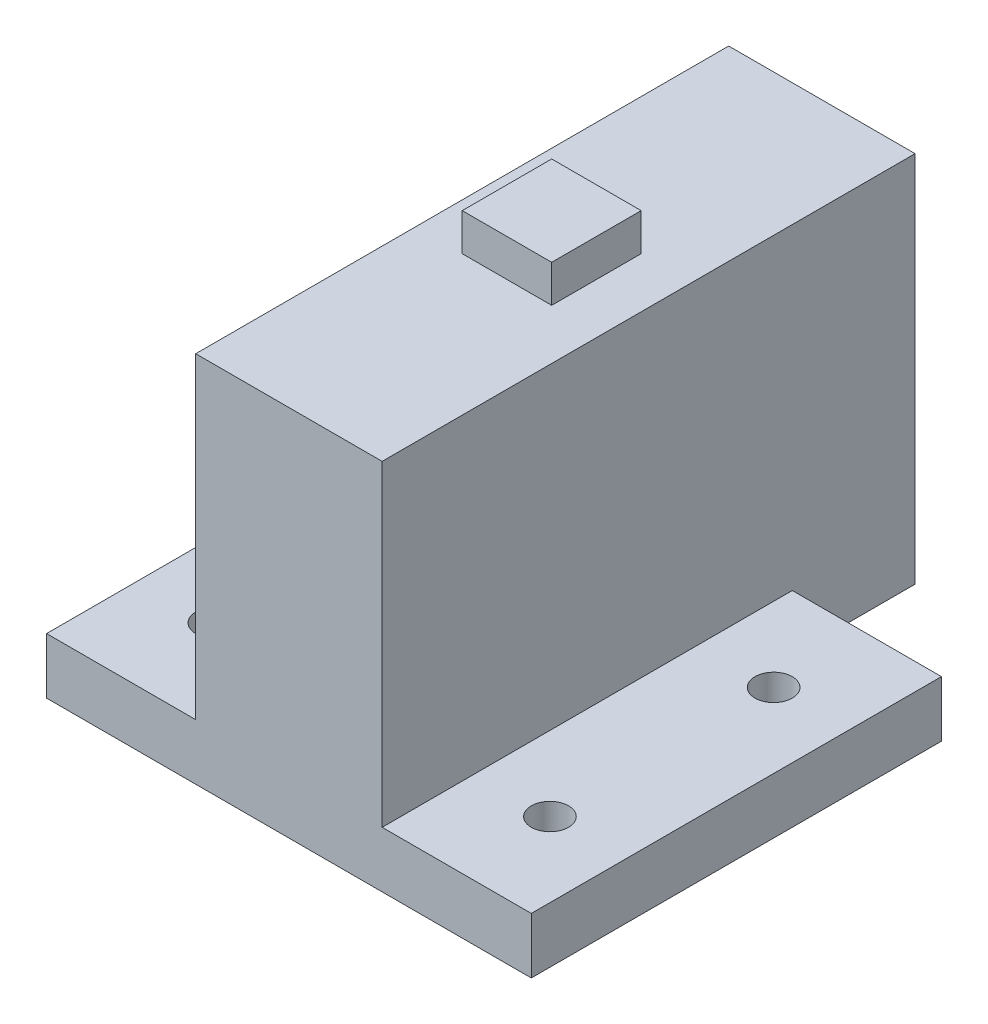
ISO-10303-21;
HEADER;
FILE_DESCRIPTION(('STEP AP214'),'2;1');
FILE_NAME('part.step','',(''),(''),'','','');
FILE_SCHEMA(('AUTOMOTIVE_DESIGN { 1 0 10303 214 1 1 1 1 }'));
ENDSEC;
DATA;
#1=APPLICATION_CONTEXT('core data for automotive mechanical design processes');
#2=APPLICATION_PROTOCOL_DEFINITION('international standard','automotive_design',2000,#1);
#3=PRODUCT_CONTEXT('',#1,'mechanical');
#4=PRODUCT('Part','Part','',(#3));
#5=PRODUCT_RELATED_PRODUCT_CATEGORY('part','',(#4));
#6=PRODUCT_DEFINITION_FORMATION('','',#4);
#7=PRODUCT_DEFINITION_CONTEXT('part definition',#1,'design');
#8=PRODUCT_DEFINITION('design','',#6,#7);
#9=PRODUCT_DEFINITION_SHAPE('','',#8);
#10=(LENGTH_UNIT() NAMED_UNIT(*) SI_UNIT(.MILLI.,.METRE.));
#11=(NAMED_UNIT(*) PLANE_ANGLE_UNIT() SI_UNIT($,.RADIAN.));
#12=(NAMED_UNIT(*) SI_UNIT($,.STERADIAN.) SOLID_ANGLE_UNIT());
#13=UNCERTAINTY_MEASURE_WITH_UNIT(LENGTH_MEASURE(1.E-05),#10,'distance_accuracy_value','');
#14=(GEOMETRIC_REPRESENTATION_CONTEXT(3) GLOBAL_UNCERTAINTY_ASSIGNED_CONTEXT((#13)) GLOBAL_UNIT_ASSIGNED_CONTEXT((#10,
#11,#12)) REPRESENTATION_CONTEXT('',''));
#15=CARTESIAN_POINT('',(0.,0.,0.));
#16=DIRECTION('',(0.,0.,1.));
#17=DIRECTION('',(1.,0.,0.));
#18=AXIS2_PLACEMENT_3D('',#15,#16,#17);
#19=CARTESIAN_POINT('',(-20.,250.,0.));
#20=DIRECTION('',(1.,0.,0.));
#21=DIRECTION('',(0.,0.,-1.));
#22=AXIS2_PLACEMENT_3D('',#19,#20,#21);
#23=PLANE('',#22);
#24=DIRECTION('',(0.,0.,1.));
#25=VECTOR('',#24,1.);
#26=CARTESIAN_POINT('',(-20.,100.,0.));
#27=LINE('',#26,#25);
#28=CARTESIAN_POINT('',(-20.,100.,-142.943134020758));
#29=VERTEX_POINT('',#28);
#30=CARTESIAN_POINT('',(-20.,100.,0.));
#31=VERTEX_POINT('',#30);
#32=EDGE_CURVE('E276',#29,#31,#27,.T.);
#33=ORIENTED_EDGE('',*,*,#32,.F.);
#34=DIRECTION('',(0.,-1.,0.));
#35=VECTOR('',#34,1.);
#36=CARTESIAN_POINT('',(-20.,250.,-142.943134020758));
#37=LINE('',#36,#35);
#38=CARTESIAN_POINT('',(-19.9999999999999,0.,-142.943134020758));
#39=VERTEX_POINT('',#38);
#40=EDGE_CURVE('E392',#29,#39,#37,.T.);
#41=ORIENTED_EDGE('',*,*,#40,.T.);
#42=DIRECTION('',(0.,0.,-1.));
#43=VECTOR('',#42,1.);
#44=CARTESIAN_POINT('',(-20.,0.,0.));
#45=LINE('',#44,#43);
#46=CARTESIAN_POINT('',(-20.,0.,-110.));
#47=VERTEX_POINT('',#46);
#48=EDGE_CURVE('E383',#47,#39,#45,.T.);
#49=ORIENTED_EDGE('',*,*,#48,.F.);
#50=DIRECTION('',(0.,-1.,0.));
#51=VECTOR('',#50,1.);
#52=CARTESIAN_POINT('',(-20.,0.,-110.));
#53=LINE('',#52,#51);
#54=CARTESIAN_POINT('',(-20.,15.,-110.));
#55=VERTEX_POINT('',#54);
#56=EDGE_CURVE('E321',#55,#47,#53,.T.);
#57=ORIENTED_EDGE('',*,*,#56,.F.);
#58=DIRECTION('',(0.,0.,-1.));
#59=VECTOR('',#58,1.);
#60=CARTESIAN_POINT('',(-20.,15.,-110.));
#61=LINE('',#60,#59);
#62=CARTESIAN_POINT('',(-20.,15.,0.));
#63=VERTEX_POINT('',#62);
#64=EDGE_CURVE('E312',#63,#55,#61,.T.);
#65=ORIENTED_EDGE('',*,*,#64,.F.);
#66=DIRECTION('',(0.,-1.,0.));
#67=VECTOR('',#66,1.);
#68=CARTESIAN_POINT('',(-20.,250.,0.));
#69=LINE('',#68,#67);
#70=EDGE_CURVE('E398',#31,#63,#69,.T.);
#71=ORIENTED_EDGE('',*,*,#70,.F.);
#72=EDGE_LOOP('',(#33,#41,#49,#57,#65,#71));
#73=FACE_BOUND('',#72,.T.);
#74=ADVANCED_FACE('F52',(#73),#23,.F.);
#75=CARTESIAN_POINT('',(30.,250.,-150.));
#76=DIRECTION('',(-1.,0.,0.));
#77=DIRECTION('',(0.,0.,1.));
#78=AXIS2_PLACEMENT_3D('',#75,#76,#77);
#79=PLANE('',#78);
#80=DIRECTION('',(0.,0.,-1.));
#81=VECTOR('',#80,1.);
#82=CARTESIAN_POINT('',(30.,100.,-150.));
#83=LINE('',#82,#81);
#84=CARTESIAN_POINT('',(30.,100.,0.));
#85=VERTEX_POINT('',#84);
#86=CARTESIAN_POINT('',(30.,100.,-142.943134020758));
#87=VERTEX_POINT('',#86);
#88=EDGE_CURVE('E273',#85,#87,#83,.T.);
#89=ORIENTED_EDGE('',*,*,#88,.F.);
#90=DIRECTION('',(0.,-1.,0.));
#91=VECTOR('',#90,1.);
#92=CARTESIAN_POINT('',(30.,250.,0.));
#93=LINE('',#92,#91);
#94=CARTESIAN_POINT('',(30.,15.,0.));
#95=VERTEX_POINT('',#94);
#96=EDGE_CURVE('E61',#85,#95,#93,.T.);
#97=ORIENTED_EDGE('',*,*,#96,.T.);
#98=DIRECTION('',(0.,0.,1.));
#99=VECTOR('',#98,1.);
#100=CARTESIAN_POINT('',(30.,15.,0.));
#101=LINE('',#100,#99);
#102=CARTESIAN_POINT('',(30.,15.,-110.));
#103=VERTEX_POINT('',#102);
#104=EDGE_CURVE('E354',#103,#95,#101,.T.);
#105=ORIENTED_EDGE('',*,*,#104,.F.);
#106=DIRECTION('',(0.,1.,0.));
#107=VECTOR('',#106,1.);
#108=CARTESIAN_POINT('',(30.,15.,-110.));
#109=LINE('',#108,#107);
#110=CARTESIAN_POINT('',(30.,0.,-110.));
#111=VERTEX_POINT('',#110);
#112=EDGE_CURVE('E348',#111,#103,#109,.T.);
#113=ORIENTED_EDGE('',*,*,#112,.F.);
#114=DIRECTION('',(0.,0.,1.));
#115=VECTOR('',#114,1.);
#116=CARTESIAN_POINT('',(30.,0.,-235.));
#117=LINE('',#116,#115);
#118=CARTESIAN_POINT('',(30.,0.,-142.943134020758));
#119=VERTEX_POINT('',#118);
#120=EDGE_CURVE('E382',#119,#111,#117,.T.);
#121=ORIENTED_EDGE('',*,*,#120,.F.);
#122=DIRECTION('',(0.,-1.,0.));
#123=VECTOR('',#122,1.);
#124=CARTESIAN_POINT('',(30.,250.,-142.943134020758));
#125=LINE('',#124,#123);
#126=EDGE_CURVE('E387',#87,#119,#125,.T.);
#127=ORIENTED_EDGE('',*,*,#126,.F.);
#128=EDGE_LOOP('',(#89,#97,#105,#113,#121,#127));
#129=FACE_BOUND('',#128,.T.);
#130=ADVANCED_FACE('F404',(#129),#79,.F.);
#131=CARTESIAN_POINT('',(-20.,250.,0.));
#132=DIRECTION('',(0.,0.,-1.));
#133=DIRECTION('',(-1.,0.,0.));
#134=AXIS2_PLACEMENT_3D('',#131,#132,#133);
#135=PLANE('',#134);
#136=DIRECTION('',(-1.,0.,0.));
#137=VECTOR('',#136,1.);
#138=CARTESIAN_POINT('',(71.,100.,0.));
#139=LINE('',#138,#137);
#140=EDGE_CURVE('E269',#85,#31,#139,.T.);
#141=ORIENTED_EDGE('',*,*,#140,.T.);
#142=ORIENTED_EDGE('',*,*,#70,.T.);
#143=DIRECTION('',(1.,0.,0.));
#144=VECTOR('',#143,1.);
#145=CARTESIAN_POINT('',(-60.,15.,0.));
#146=LINE('',#145,#144);
#147=CARTESIAN_POINT('',(-60.,15.,0.));
#148=VERTEX_POINT('',#147);
#149=EDGE_CURVE('E344',#148,#63,#146,.T.);
#150=ORIENTED_EDGE('',*,*,#149,.F.);
#151=DIRECTION('',(0.,1.,0.));
#152=VECTOR('',#151,1.);
#153=CARTESIAN_POINT('',(-60.,15.,0.));
#154=LINE('',#153,#152);
#155=CARTESIAN_POINT('',(-60.,0.,0.));
#156=VERTEX_POINT('',#155);
#157=EDGE_CURVE('E320',#156,#148,#154,.T.);
#158=ORIENTED_EDGE('',*,*,#157,.F.);
#159=DIRECTION('',(1.,0.,0.));
#160=VECTOR('',#159,1.);
#161=CARTESIAN_POINT('',(-20.,0.,0.));
#162=LINE('',#161,#160);
#163=CARTESIAN_POINT('',(70.,0.,0.));
#164=VERTEX_POINT('',#163);
#165=EDGE_CURVE('E395',#156,#164,#162,.T.);
#166=ORIENTED_EDGE('',*,*,#165,.T.);
#167=DIRECTION('',(0.,-1.,0.));
#168=VECTOR('',#167,1.);
#169=CARTESIAN_POINT('',(70.,0.,0.));
#170=LINE('',#169,#168);
#171=CARTESIAN_POINT('',(70.,15.,0.));
#172=VERTEX_POINT('',#171);
#173=EDGE_CURVE('E360',#172,#164,#170,.T.);
#174=ORIENTED_EDGE('',*,*,#173,.F.);
#175=DIRECTION('',(-1.,0.,0.));
#176=VECTOR('',#175,1.);
#177=CARTESIAN_POINT('',(70.,15.,0.));
#178=LINE('',#177,#176);
#179=EDGE_CURVE('E364',#172,#95,#178,.T.);
#180=ORIENTED_EDGE('',*,*,#179,.T.);
#181=ORIENTED_EDGE('',*,*,#96,.F.);
#182=EDGE_LOOP('',(#141,#142,#150,#158,#166,#174,#180,#181));
#183=FACE_BOUND('',#182,.T.);
#184=ADVANCED_FACE('F54',(#183),#135,.F.);
#185=CARTESIAN_POINT('',(-91.,250.,-142.943134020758));
#186=DIRECTION('',(0.,0.,1.));
#187=DIRECTION('',(0.,-1.,0.));
#188=AXIS2_PLACEMENT_3D('',#185,#186,#187);
#189=PLANE('',#188);
#190=DIRECTION('',(1.,0.,0.));
#191=VECTOR('',#190,1.);
#192=CARTESIAN_POINT('',(17.5,62.5,-142.943134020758));
#193=LINE('',#192,#191);
#194=CARTESIAN_POINT('',(-7.49999999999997,62.5,-142.943134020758));
#195=VERTEX_POINT('',#194);
#196=CARTESIAN_POINT('',(17.5,62.5,-142.943134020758));
#197=VERTEX_POINT('',#196);
#198=EDGE_CURVE('E213',#195,#197,#193,.T.);
#199=ORIENTED_EDGE('',*,*,#198,.F.);
#200=DIRECTION('',(0.,1.,0.));
#201=VECTOR('',#200,1.);
#202=CARTESIAN_POINT('',(-7.49999999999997,37.5,-142.943134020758));
#203=LINE('',#202,#201);
#204=CARTESIAN_POINT('',(-7.49999999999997,37.5,-142.943134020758));
#205=VERTEX_POINT('',#204);
#206=EDGE_CURVE('E68',#205,#195,#203,.T.);
#207=ORIENTED_EDGE('',*,*,#206,.F.);
#208=DIRECTION('',(-1.,0.,0.));
#209=VECTOR('',#208,1.);
#210=CARTESIAN_POINT('',(17.5,37.5,-142.943134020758));
#211=LINE('',#210,#209);
#212=CARTESIAN_POINT('',(17.5,37.5,-142.943134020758));
#213=VERTEX_POINT('',#212);
#214=EDGE_CURVE('E200',#213,#205,#211,.T.);
#215=ORIENTED_EDGE('',*,*,#214,.F.);
#216=DIRECTION('',(0.,-1.,0.));
#217=VECTOR('',#216,1.);
#218=CARTESIAN_POINT('',(17.5,37.5,-142.943134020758));
#219=LINE('',#218,#217);
#220=EDGE_CURVE('E204',#197,#213,#219,.T.);
#221=ORIENTED_EDGE('',*,*,#220,.F.);
#222=EDGE_LOOP('',(#199,#207,#215,#221));
#223=FACE_BOUND('',#222,.T.);
#224=DIRECTION('',(-1.,0.,0.));
#225=VECTOR('',#224,1.);
#226=CARTESIAN_POINT('',(-91.,100.,-142.943134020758));
#227=LINE('',#226,#225);
#228=EDGE_CURVE('E12',#87,#29,#227,.T.);
#229=ORIENTED_EDGE('',*,*,#228,.F.);
#230=ORIENTED_EDGE('',*,*,#126,.T.);
#231=DIRECTION('',(-1.,0.,0.));
#232=VECTOR('',#231,1.);
#233=CARTESIAN_POINT('',(105.,0.,-142.943134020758));
#234=LINE('',#233,#232);
#235=EDGE_CURVE('E279',#119,#39,#234,.T.);
#236=ORIENTED_EDGE('',*,*,#235,.T.);
#237=ORIENTED_EDGE('',*,*,#40,.F.);
#238=EDGE_LOOP('',(#229,#230,#236,#237));
#239=FACE_BOUND('',#238,.T.);
#240=ADVANCED_FACE('F428',(#223,#239),#189,.F.);
#241=CARTESIAN_POINT('',(0.,0.,0.));
#242=DIRECTION('',(0.,-1.,0.));
#243=DIRECTION('',(0.,0.,-1.));
#244=AXIS2_PLACEMENT_3D('',#241,#242,#243);
#245=PLANE('',#244);
#246=CARTESIAN_POINT('',(-40.,0.,-25.));
#247=DIRECTION('',(0.,1.,0.));
#248=DIRECTION('',(0.,0.,1.));
#249=AXIS2_PLACEMENT_3D('',#246,#247,#248);
#250=CIRCLE('',#249,5.);
#251=CARTESIAN_POINT('',(-40.,0.,-20.));
#252=VERTEX_POINT('',#251);
#253=EDGE_CURVE('E297',#252,#252,#250,.T.);
#254=ORIENTED_EDGE('',*,*,#253,.T.);
#255=EDGE_LOOP('',(#254));
#256=FACE_BOUND('',#255,.T.);
#257=CARTESIAN_POINT('',(50.,0.,-85.));
#258=DIRECTION('',(0.,1.,0.));
#259=DIRECTION('',(0.,0.,1.));
#260=AXIS2_PLACEMENT_3D('',#257,#258,#259);
#261=CIRCLE('',#260,5.);
#262=CARTESIAN_POINT('',(50.,0.,-80.));
#263=VERTEX_POINT('',#262);
#264=EDGE_CURVE('E288',#263,#263,#261,.T.);
#265=ORIENTED_EDGE('',*,*,#264,.T.);
#266=EDGE_LOOP('',(#265));
#267=FACE_BOUND('',#266,.T.);
#268=CARTESIAN_POINT('',(50.,0.,-25.));
#269=DIRECTION('',(0.,1.,0.));
#270=DIRECTION('',(0.,0.,1.));
#271=AXIS2_PLACEMENT_3D('',#268,#269,#270);
#272=CIRCLE('',#271,5.);
#273=CARTESIAN_POINT('',(50.,0.,-20.));
#274=VERTEX_POINT('',#273);
#275=EDGE_CURVE('E283',#274,#274,#272,.T.);
#276=ORIENTED_EDGE('',*,*,#275,.T.);
#277=EDGE_LOOP('',(#276));
#278=FACE_BOUND('',#277,.T.);
#279=CARTESIAN_POINT('',(-40.,0.,-85.));
#280=DIRECTION('',(0.,1.,0.));
#281=DIRECTION('',(0.,0.,1.));
#282=AXIS2_PLACEMENT_3D('',#279,#280,#281);
#283=CIRCLE('',#282,5.);
#284=CARTESIAN_POINT('',(-40.,0.,-80.));
#285=VERTEX_POINT('',#284);
#286=EDGE_CURVE('E308',#285,#285,#283,.T.);
#287=ORIENTED_EDGE('',*,*,#286,.T.);
#288=EDGE_LOOP('',(#287));
#289=FACE_BOUND('',#288,.T.);
#290=ORIENTED_EDGE('',*,*,#48,.T.);
#291=ORIENTED_EDGE('',*,*,#235,.F.);
#292=ORIENTED_EDGE('',*,*,#120,.T.);
#293=DIRECTION('',(-1.,0.,0.));
#294=VECTOR('',#293,1.);
#295=CARTESIAN_POINT('',(70.,0.,-110.));
#296=LINE('',#295,#294);
#297=CARTESIAN_POINT('',(70.,0.,-110.));
#298=VERTEX_POINT('',#297);
#299=EDGE_CURVE('E378',#298,#111,#296,.T.);
#300=ORIENTED_EDGE('',*,*,#299,.F.);
#301=DIRECTION('',(0.,0.,-1.));
#302=VECTOR('',#301,1.);
#303=CARTESIAN_POINT('',(70.,0.,-110.));
#304=LINE('',#303,#302);
#305=EDGE_CURVE('E349',#164,#298,#304,.T.);
#306=ORIENTED_EDGE('',*,*,#305,.F.);
#307=ORIENTED_EDGE('',*,*,#165,.F.);
#308=DIRECTION('',(0.,0.,1.));
#309=VECTOR('',#308,1.);
#310=CARTESIAN_POINT('',(-60.,0.,0.));
#311=LINE('',#310,#309);
#312=CARTESIAN_POINT('',(-60.,0.,-110.));
#313=VERTEX_POINT('',#312);
#314=EDGE_CURVE('E316',#313,#156,#311,.T.);
#315=ORIENTED_EDGE('',*,*,#314,.F.);
#316=DIRECTION('',(1.,0.,0.));
#317=VECTOR('',#316,1.);
#318=CARTESIAN_POINT('',(-60.,0.,-110.));
#319=LINE('',#318,#317);
#320=EDGE_CURVE('E330',#313,#47,#319,.T.);
#321=ORIENTED_EDGE('',*,*,#320,.T.);
#322=EDGE_LOOP('',(#290,#291,#292,#300,#306,#307,#315,#321));
#323=FACE_BOUND('',#322,.T.);
#324=ADVANCED_FACE('F420',(#256,#267,#278,#289,#323),#245,.T.);
#325=CARTESIAN_POINT('',(70.,15.,-110.));
#326=DIRECTION('',(0.,0.,1.));
#327=DIRECTION('',(1.,0.,0.));
#328=AXIS2_PLACEMENT_3D('',#325,#326,#327);
#329=PLANE('',#328);
#330=ORIENTED_EDGE('',*,*,#112,.T.);
#331=DIRECTION('',(-1.,0.,0.));
#332=VECTOR('',#331,1.);
#333=CARTESIAN_POINT('',(70.,15.,-110.));
#334=LINE('',#333,#332);
#335=CARTESIAN_POINT('',(70.,15.,-110.));
#336=VERTEX_POINT('',#335);
#337=EDGE_CURVE('E374',#336,#103,#334,.T.);
#338=ORIENTED_EDGE('',*,*,#337,.F.);
#339=DIRECTION('',(0.,1.,0.));
#340=VECTOR('',#339,1.);
#341=CARTESIAN_POINT('',(70.,15.,-110.));
#342=LINE('',#341,#340);
#343=EDGE_CURVE('E353',#298,#336,#342,.T.);
#344=ORIENTED_EDGE('',*,*,#343,.F.);
#345=ORIENTED_EDGE('',*,*,#299,.T.);
#346=EDGE_LOOP('',(#330,#338,#344,#345));
#347=FACE_BOUND('',#346,.T.);
#348=ADVANCED_FACE('F425',(#347),#329,.F.);
#349=CARTESIAN_POINT('',(70.,15.,0.));
#350=DIRECTION('',(0.,-1.,0.));
#351=DIRECTION('',(0.,0.,-1.));
#352=AXIS2_PLACEMENT_3D('',#349,#350,#351);
#353=PLANE('',#352);
#354=CARTESIAN_POINT('',(50.,15.,-85.));
#355=DIRECTION('',(0.,1.,0.));
#356=DIRECTION('',(0.,0.,1.));
#357=AXIS2_PLACEMENT_3D('',#354,#355,#356);
#358=CIRCLE('',#357,5.);
#359=CARTESIAN_POINT('',(50.,15.,-80.));
#360=VERTEX_POINT('',#359);
#361=EDGE_CURVE('E301',#360,#360,#358,.T.);
#362=ORIENTED_EDGE('',*,*,#361,.F.);
#363=EDGE_LOOP('',(#362));
#364=FACE_BOUND('',#363,.T.);
#365=CARTESIAN_POINT('',(50.,15.,-25.));
#366=DIRECTION('',(0.,1.,0.));
#367=DIRECTION('',(0.,0.,1.));
#368=AXIS2_PLACEMENT_3D('',#365,#366,#367);
#369=CIRCLE('',#368,5.);
#370=CARTESIAN_POINT('',(50.,15.,-20.));
#371=VERTEX_POINT('',#370);
#372=EDGE_CURVE('E284',#371,#371,#369,.T.);
#373=ORIENTED_EDGE('',*,*,#372,.F.);
#374=EDGE_LOOP('',(#373));
#375=FACE_BOUND('',#374,.T.);
#376=ORIENTED_EDGE('',*,*,#104,.T.);
#377=ORIENTED_EDGE('',*,*,#179,.F.);
#378=DIRECTION('',(0.,0.,1.));
#379=VECTOR('',#378,1.);
#380=CARTESIAN_POINT('',(70.,15.,0.));
#381=LINE('',#380,#379);
#382=EDGE_CURVE('E357',#336,#172,#381,.T.);
#383=ORIENTED_EDGE('',*,*,#382,.F.);
#384=ORIENTED_EDGE('',*,*,#337,.T.);
#385=EDGE_LOOP('',(#376,#377,#383,#384));
#386=FACE_BOUND('',#385,.T.);
#387=ADVANCED_FACE('F410',(#364,#375,#386),#353,.F.);
#388=CARTESIAN_POINT('',(70.,0.,0.));
#389=DIRECTION('',(-1.,0.,0.));
#390=DIRECTION('',(0.,0.,1.));
#391=AXIS2_PLACEMENT_3D('',#388,#389,#390);
#392=PLANE('',#391);
#393=ORIENTED_EDGE('',*,*,#305,.T.);
#394=ORIENTED_EDGE('',*,*,#343,.T.);
#395=ORIENTED_EDGE('',*,*,#382,.T.);
#396=ORIENTED_EDGE('',*,*,#173,.T.);
#397=EDGE_LOOP('',(#393,#394,#395,#396));
#398=FACE_BOUND('',#397,.T.);
#399=ADVANCED_FACE('F417',(#398),#392,.F.);
#400=CARTESIAN_POINT('',(-60.,15.,-110.));
#401=DIRECTION('',(0.,-1.,0.));
#402=DIRECTION('',(0.,0.,-1.));
#403=AXIS2_PLACEMENT_3D('',#400,#401,#402);
#404=PLANE('',#403);
#405=CARTESIAN_POINT('',(-40.,15.,-25.));
#406=DIRECTION('',(0.,1.,0.));
#407=DIRECTION('',(0.,0.,1.));
#408=AXIS2_PLACEMENT_3D('',#405,#406,#407);
#409=CIRCLE('',#408,5.);
#410=CARTESIAN_POINT('',(-40.,15.,-20.));
#411=VERTEX_POINT('',#410);
#412=EDGE_CURVE('E292',#411,#411,#409,.T.);
#413=ORIENTED_EDGE('',*,*,#412,.F.);
#414=EDGE_LOOP('',(#413));
#415=FACE_BOUND('',#414,.T.);
#416=CARTESIAN_POINT('',(-40.,15.,-85.));
#417=DIRECTION('',(0.,1.,0.));
#418=DIRECTION('',(0.,0.,1.));
#419=AXIS2_PLACEMENT_3D('',#416,#417,#418);
#420=CIRCLE('',#419,5.);
#421=CARTESIAN_POINT('',(-40.,15.,-80.));
#422=VERTEX_POINT('',#421);
#423=EDGE_CURVE('E296',#422,#422,#420,.T.);
#424=ORIENTED_EDGE('',*,*,#423,.F.);
#425=EDGE_LOOP('',(#424));
#426=FACE_BOUND('',#425,.T.);
#427=ORIENTED_EDGE('',*,*,#64,.T.);
#428=DIRECTION('',(1.,0.,0.));
#429=VECTOR('',#428,1.);
#430=CARTESIAN_POINT('',(-60.,15.,-110.));
#431=LINE('',#430,#429);
#432=CARTESIAN_POINT('',(-60.,15.,-110.));
#433=VERTEX_POINT('',#432);
#434=EDGE_CURVE('E340',#433,#55,#431,.T.);
#435=ORIENTED_EDGE('',*,*,#434,.F.);
#436=DIRECTION('',(0.,0.,-1.));
#437=VECTOR('',#436,1.);
#438=CARTESIAN_POINT('',(-60.,15.,-110.));
#439=LINE('',#438,#437);
#440=EDGE_CURVE('E324',#148,#433,#439,.T.);
#441=ORIENTED_EDGE('',*,*,#440,.F.);
#442=ORIENTED_EDGE('',*,*,#149,.T.);
#443=EDGE_LOOP('',(#427,#435,#441,#442));
#444=FACE_BOUND('',#443,.T.);
#445=ADVANCED_FACE('F440',(#415,#426,#444),#404,.F.);
#446=CARTESIAN_POINT('',(-60.,0.,-110.));
#447=DIRECTION('',(0.,0.,1.));
#448=DIRECTION('',(1.,0.,0.));
#449=AXIS2_PLACEMENT_3D('',#446,#447,#448);
#450=PLANE('',#449);
#451=ORIENTED_EDGE('',*,*,#56,.T.);
#452=ORIENTED_EDGE('',*,*,#320,.F.);
#453=DIRECTION('',(0.,-1.,0.));
#454=VECTOR('',#453,1.);
#455=CARTESIAN_POINT('',(-60.,0.,-110.));
#456=LINE('',#455,#454);
#457=EDGE_CURVE('E327',#433,#313,#456,.T.);
#458=ORIENTED_EDGE('',*,*,#457,.F.);
#459=ORIENTED_EDGE('',*,*,#434,.T.);
#460=EDGE_LOOP('',(#451,#452,#458,#459));
#461=FACE_BOUND('',#460,.T.);
#462=ADVANCED_FACE('F435',(#461),#450,.F.);
#463=CARTESIAN_POINT('',(-60.,0.,0.));
#464=DIRECTION('',(1.,0.,0.));
#465=DIRECTION('',(0.,0.,-1.));
#466=AXIS2_PLACEMENT_3D('',#463,#464,#465);
#467=PLANE('',#466);
#468=ORIENTED_EDGE('',*,*,#314,.T.);
#469=ORIENTED_EDGE('',*,*,#157,.T.);
#470=ORIENTED_EDGE('',*,*,#440,.T.);
#471=ORIENTED_EDGE('',*,*,#457,.T.);
#472=EDGE_LOOP('',(#468,#469,#470,#471));
#473=FACE_BOUND('',#472,.T.);
#474=ADVANCED_FACE('F484',(#473),#467,.F.);
#475=CARTESIAN_POINT('',(-40.,0.,-85.));
#476=DIRECTION('',(0.,1.,0.));
#477=DIRECTION('',(0.,0.,1.));
#478=AXIS2_PLACEMENT_3D('',#475,#476,#477);
#479=CYLINDRICAL_SURFACE('',#478,5.);
#480=ORIENTED_EDGE('',*,*,#286,.F.);
#481=EDGE_LOOP('',(#480));
#482=FACE_BOUND('',#481,.T.);
#483=ORIENTED_EDGE('',*,*,#423,.T.);
#484=EDGE_LOOP('',(#483));
#485=FACE_BOUND('',#484,.T.);
#486=ADVANCED_FACE('F487',(#482,#485),#479,.F.);
#487=CARTESIAN_POINT('',(-40.,0.,-25.));
#488=DIRECTION('',(0.,1.,0.));
#489=DIRECTION('',(0.,0.,1.));
#490=AXIS2_PLACEMENT_3D('',#487,#488,#489);
#491=CYLINDRICAL_SURFACE('',#490,5.);
#492=ORIENTED_EDGE('',*,*,#253,.F.);
#493=EDGE_LOOP('',(#492));
#494=FACE_BOUND('',#493,.T.);
#495=ORIENTED_EDGE('',*,*,#412,.T.);
#496=EDGE_LOOP('',(#495));
#497=FACE_BOUND('',#496,.T.);
#498=ADVANCED_FACE('F490',(#494,#497),#491,.F.);
#499=CARTESIAN_POINT('',(50.,0.,-25.));
#500=DIRECTION('',(0.,1.,0.));
#501=DIRECTION('',(0.,0.,1.));
#502=AXIS2_PLACEMENT_3D('',#499,#500,#501);
#503=CYLINDRICAL_SURFACE('',#502,5.);
#504=ORIENTED_EDGE('',*,*,#275,.F.);
#505=EDGE_LOOP('',(#504));
#506=FACE_BOUND('',#505,.T.);
#507=ORIENTED_EDGE('',*,*,#372,.T.);
#508=EDGE_LOOP('',(#507));
#509=FACE_BOUND('',#508,.T.);
#510=ADVANCED_FACE('F457',(#506,#509),#503,.F.);
#511=CARTESIAN_POINT('',(50.,0.,-85.));
#512=DIRECTION('',(0.,1.,0.));
#513=DIRECTION('',(0.,0.,1.));
#514=AXIS2_PLACEMENT_3D('',#511,#512,#513);
#515=CYLINDRICAL_SURFACE('',#514,5.);
#516=ORIENTED_EDGE('',*,*,#264,.F.);
#517=EDGE_LOOP('',(#516));
#518=FACE_BOUND('',#517,.T.);
#519=ORIENTED_EDGE('',*,*,#361,.T.);
#520=EDGE_LOOP('',(#519));
#521=FACE_BOUND('',#520,.T.);
#522=ADVANCED_FACE('F447',(#518,#521),#515,.F.);
#523=CARTESIAN_POINT('',(71.,100.,-142.943134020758));
#524=DIRECTION('',(0.,1.,0.));
#525=DIRECTION('',(0.,0.,1.));
#526=AXIS2_PLACEMENT_3D('',#523,#524,#525);
#527=PLANE('',#526);
#528=DIRECTION('',(0.,0.,-1.));
#529=VECTOR('',#528,1.);
#530=CARTESIAN_POINT('',(16.5,100.,-58.9715670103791));
#531=LINE('',#530,#529);
#532=CARTESIAN_POINT('',(16.5,100.,-58.9715670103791));
#533=VERTEX_POINT('',#532);
#534=CARTESIAN_POINT('',(16.5,100.,-82.9715670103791));
#535=VERTEX_POINT('',#534);
#536=EDGE_CURVE('E76',#533,#535,#531,.T.);
#537=ORIENTED_EDGE('',*,*,#536,.F.);
#538=DIRECTION('',(1.,0.,0.));
#539=VECTOR('',#538,1.);
#540=CARTESIAN_POINT('',(-7.49999999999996,100.,-58.9715670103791));
#541=LINE('',#540,#539);
#542=CARTESIAN_POINT('',(-7.49999999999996,100.,-58.9715670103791));
#543=VERTEX_POINT('',#542);
#544=EDGE_CURVE('E232',#543,#533,#541,.T.);
#545=ORIENTED_EDGE('',*,*,#544,.F.);
#546=DIRECTION('',(0.,0.,1.));
#547=VECTOR('',#546,1.);
#548=CARTESIAN_POINT('',(-7.49999999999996,100.,-58.9715670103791));
#549=LINE('',#548,#547);
#550=CARTESIAN_POINT('',(-7.49999999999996,100.,-82.9715670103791));
#551=VERTEX_POINT('',#550);
#552=EDGE_CURVE('E248',#551,#543,#549,.T.);
#553=ORIENTED_EDGE('',*,*,#552,.F.);
#554=DIRECTION('',(-1.,0.,0.));
#555=VECTOR('',#554,1.);
#556=CARTESIAN_POINT('',(-7.49999999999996,100.,-82.9715670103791));
#557=LINE('',#556,#555);
#558=EDGE_CURVE('E244',#535,#551,#557,.T.);
#559=ORIENTED_EDGE('',*,*,#558,.F.);
#560=EDGE_LOOP('',(#537,#545,#553,#559));
#561=FACE_BOUND('',#560,.T.);
#562=ORIENTED_EDGE('',*,*,#32,.T.);
#563=ORIENTED_EDGE('',*,*,#140,.F.);
#564=ORIENTED_EDGE('',*,*,#88,.T.);
#565=ORIENTED_EDGE('',*,*,#228,.T.);
#566=EDGE_LOOP('',(#562,#563,#564,#565));
#567=FACE_BOUND('',#566,.T.);
#568=ADVANCED_FACE('F444',(#561,#567),#527,.T.);
#569=CARTESIAN_POINT('',(16.5,110.,-58.9715670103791));
#570=DIRECTION('',(-1.,0.,0.));
#571=DIRECTION('',(0.,0.,1.));
#572=AXIS2_PLACEMENT_3D('',#569,#570,#571);
#573=PLANE('',#572);
#574=ORIENTED_EDGE('',*,*,#536,.T.);
#575=DIRECTION('',(0.,-1.,0.));
#576=VECTOR('',#575,1.);
#577=CARTESIAN_POINT('',(16.5,110.,-82.9715670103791));
#578=LINE('',#577,#576);
#579=CARTESIAN_POINT('',(16.5,110.,-82.9715670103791));
#580=VERTEX_POINT('',#579);
#581=EDGE_CURVE('E265',#580,#535,#578,.T.);
#582=ORIENTED_EDGE('',*,*,#581,.F.);
#583=DIRECTION('',(0.,0.,-1.));
#584=VECTOR('',#583,1.);
#585=CARTESIAN_POINT('',(16.5,110.,-58.9715670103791));
#586=LINE('',#585,#584);
#587=CARTESIAN_POINT('',(16.5,110.,-58.9715670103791));
#588=VERTEX_POINT('',#587);
#589=EDGE_CURVE('E227',#588,#580,#586,.T.);
#590=ORIENTED_EDGE('',*,*,#589,.F.);
#591=DIRECTION('',(0.,-1.,0.));
#592=VECTOR('',#591,1.);
#593=CARTESIAN_POINT('',(16.5,110.,-58.9715670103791));
#594=LINE('',#593,#592);
#595=EDGE_CURVE('E241',#588,#533,#594,.T.);
#596=ORIENTED_EDGE('',*,*,#595,.T.);
#597=EDGE_LOOP('',(#574,#582,#590,#596));
#598=FACE_BOUND('',#597,.T.);
#599=ADVANCED_FACE('F446',(#598),#573,.F.);
#600=CARTESIAN_POINT('',(-7.49999999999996,110.,-82.9715670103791));
#601=DIRECTION('',(0.,0.,1.));
#602=DIRECTION('',(0.,-1.,0.));
#603=AXIS2_PLACEMENT_3D('',#600,#601,#602);
#604=PLANE('',#603);
#605=ORIENTED_EDGE('',*,*,#558,.T.);
#606=DIRECTION('',(0.,-1.,0.));
#607=VECTOR('',#606,1.);
#608=CARTESIAN_POINT('',(-7.49999999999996,110.,-82.9715670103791));
#609=LINE('',#608,#607);
#610=CARTESIAN_POINT('',(-7.49999999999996,110.,-82.9715670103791));
#611=VERTEX_POINT('',#610);
#612=EDGE_CURVE('E261',#611,#551,#609,.T.);
#613=ORIENTED_EDGE('',*,*,#612,.F.);
#614=DIRECTION('',(-1.,0.,0.));
#615=VECTOR('',#614,1.);
#616=CARTESIAN_POINT('',(-7.49999999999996,110.,-82.9715670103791));
#617=LINE('',#616,#615);
#618=EDGE_CURVE('E231',#580,#611,#617,.T.);
#619=ORIENTED_EDGE('',*,*,#618,.F.);
#620=ORIENTED_EDGE('',*,*,#581,.T.);
#621=EDGE_LOOP('',(#605,#613,#619,#620));
#622=FACE_BOUND('',#621,.T.);
#623=ADVANCED_FACE('F453',(#622),#604,.F.);
#624=CARTESIAN_POINT('',(-7.49999999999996,110.,-58.9715670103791));
#625=DIRECTION('',(1.,0.,0.));
#626=DIRECTION('',(0.,0.,-1.));
#627=AXIS2_PLACEMENT_3D('',#624,#625,#626);
#628=PLANE('',#627);
#629=ORIENTED_EDGE('',*,*,#552,.T.);
#630=DIRECTION('',(0.,-1.,0.));
#631=VECTOR('',#630,1.);
#632=CARTESIAN_POINT('',(-7.49999999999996,110.,-58.9715670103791));
#633=LINE('',#632,#631);
#634=CARTESIAN_POINT('',(-7.49999999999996,110.,-58.9715670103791));
#635=VERTEX_POINT('',#634);
#636=EDGE_CURVE('E257',#635,#543,#633,.T.);
#637=ORIENTED_EDGE('',*,*,#636,.F.);
#638=DIRECTION('',(0.,0.,1.));
#639=VECTOR('',#638,1.);
#640=CARTESIAN_POINT('',(-7.49999999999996,110.,-58.9715670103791));
#641=LINE('',#640,#639);
#642=EDGE_CURVE('E235',#611,#635,#641,.T.);
#643=ORIENTED_EDGE('',*,*,#642,.F.);
#644=ORIENTED_EDGE('',*,*,#612,.T.);
#645=EDGE_LOOP('',(#629,#637,#643,#644));
#646=FACE_BOUND('',#645,.T.);
#647=ADVANCED_FACE('F624',(#646),#628,.F.);
#648=CARTESIAN_POINT('',(-7.49999999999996,110.,-58.9715670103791));
#649=DIRECTION('',(0.,0.,-1.));
#650=DIRECTION('',(-1.,0.,0.));
#651=AXIS2_PLACEMENT_3D('',#648,#649,#650);
#652=PLANE('',#651);
#653=ORIENTED_EDGE('',*,*,#544,.T.);
#654=ORIENTED_EDGE('',*,*,#595,.F.);
#655=DIRECTION('',(1.,0.,0.));
#656=VECTOR('',#655,1.);
#657=CARTESIAN_POINT('',(-7.49999999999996,110.,-58.9715670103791));
#658=LINE('',#657,#656);
#659=EDGE_CURVE('E238',#635,#588,#658,.T.);
#660=ORIENTED_EDGE('',*,*,#659,.F.);
#661=ORIENTED_EDGE('',*,*,#636,.T.);
#662=EDGE_LOOP('',(#653,#654,#660,#661));
#663=FACE_BOUND('',#662,.T.);
#664=ADVANCED_FACE('F615',(#663),#652,.F.);
#665=CARTESIAN_POINT('',(0.,110.,0.));
#666=DIRECTION('',(0.,-1.,0.));
#667=DIRECTION('',(0.,0.,-1.));
#668=AXIS2_PLACEMENT_3D('',#665,#666,#667);
#669=PLANE('',#668);
#670=ORIENTED_EDGE('',*,*,#589,.T.);
#671=ORIENTED_EDGE('',*,*,#618,.T.);
#672=ORIENTED_EDGE('',*,*,#642,.T.);
#673=ORIENTED_EDGE('',*,*,#659,.T.);
#674=EDGE_LOOP('',(#670,#671,#672,#673));
#675=FACE_BOUND('',#674,.T.);
#676=ADVANCED_FACE('F554',(#675),#669,.F.);
#677=CARTESIAN_POINT('',(-7.49999999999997,37.5,-132.943134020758));
#678=DIRECTION('',(-1.,0.,0.));
#679=DIRECTION('',(0.,0.,1.));
#680=AXIS2_PLACEMENT_3D('',#677,#678,#679);
#681=PLANE('',#680);
#682=ORIENTED_EDGE('',*,*,#206,.T.);
#683=DIRECTION('',(0.,0.,-1.));
#684=VECTOR('',#683,1.);
#685=CARTESIAN_POINT('',(-7.49999999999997,62.5,-132.943134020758));
#686=LINE('',#685,#684);
#687=CARTESIAN_POINT('',(-7.49999999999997,62.5,-132.943134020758));
#688=VERTEX_POINT('',#687);
#689=EDGE_CURVE('E175',#688,#195,#686,.T.);
#690=ORIENTED_EDGE('',*,*,#689,.F.);
#691=DIRECTION('',(0.,1.,0.));
#692=VECTOR('',#691,1.);
#693=CARTESIAN_POINT('',(-7.49999999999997,37.5,-132.943134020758));
#694=LINE('',#693,#692);
#695=CARTESIAN_POINT('',(-7.49999999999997,37.5,-132.943134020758));
#696=VERTEX_POINT('',#695);
#697=EDGE_CURVE('E179',#696,#688,#694,.T.);
#698=ORIENTED_EDGE('',*,*,#697,.F.);
#699=DIRECTION('',(0.,0.,-1.));
#700=VECTOR('',#699,1.);
#701=CARTESIAN_POINT('',(-7.49999999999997,37.5,-132.943134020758));
#702=LINE('',#701,#700);
#703=EDGE_CURVE('E219',#696,#205,#702,.T.);
#704=ORIENTED_EDGE('',*,*,#703,.T.);
#705=EDGE_LOOP('',(#682,#690,#698,#704));
#706=FACE_BOUND('',#705,.T.);
#707=ADVANCED_FACE('F177',(#706),#681,.F.);
#708=CARTESIAN_POINT('',(17.5,37.5,-132.943134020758));
#709=DIRECTION('',(0.,-1.,0.));
#710=DIRECTION('',(0.,0.,-1.));
#711=AXIS2_PLACEMENT_3D('',#708,#709,#710);
#712=PLANE('',#711);
#713=ORIENTED_EDGE('',*,*,#214,.T.);
#714=ORIENTED_EDGE('',*,*,#703,.F.);
#715=DIRECTION('',(-1.,0.,0.));
#716=VECTOR('',#715,1.);
#717=CARTESIAN_POINT('',(17.5,37.5,-132.943134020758));
#718=LINE('',#717,#716);
#719=CARTESIAN_POINT('',(17.5,37.5,-132.943134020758));
#720=VERTEX_POINT('',#719);
#721=EDGE_CURVE('E186',#720,#696,#718,.T.);
#722=ORIENTED_EDGE('',*,*,#721,.F.);
#723=DIRECTION('',(0.,0.,-1.));
#724=VECTOR('',#723,1.);
#725=CARTESIAN_POINT('',(17.5,37.5,-132.943134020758));
#726=LINE('',#725,#724);
#727=EDGE_CURVE('E222',#720,#213,#726,.T.);
#728=ORIENTED_EDGE('',*,*,#727,.T.);
#729=EDGE_LOOP('',(#713,#714,#722,#728));
#730=FACE_BOUND('',#729,.T.);
#731=ADVANCED_FACE('F563',(#730),#712,.F.);
#732=CARTESIAN_POINT('',(17.5,37.5,-132.943134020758));
#733=DIRECTION('',(1.,0.,0.));
#734=DIRECTION('',(0.,0.,-1.));
#735=AXIS2_PLACEMENT_3D('',#732,#733,#734);
#736=PLANE('',#735);
#737=ORIENTED_EDGE('',*,*,#220,.T.);
#738=ORIENTED_EDGE('',*,*,#727,.F.);
#739=DIRECTION('',(0.,-1.,0.));
#740=VECTOR('',#739,1.);
#741=CARTESIAN_POINT('',(17.5,37.5,-132.943134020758));
#742=LINE('',#741,#740);
#743=CARTESIAN_POINT('',(17.5,62.5,-132.943134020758));
#744=VERTEX_POINT('',#743);
#745=EDGE_CURVE('E195',#744,#720,#742,.T.);
#746=ORIENTED_EDGE('',*,*,#745,.F.);
#747=DIRECTION('',(0.,0.,-1.));
#748=VECTOR('',#747,1.);
#749=CARTESIAN_POINT('',(17.5,62.5,-132.943134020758));
#750=LINE('',#749,#748);
#751=EDGE_CURVE('E185',#744,#197,#750,.T.);
#752=ORIENTED_EDGE('',*,*,#751,.T.);
#753=EDGE_LOOP('',(#737,#738,#746,#752));
#754=FACE_BOUND('',#753,.T.);
#755=ADVANCED_FACE('F573',(#754),#736,.F.);
#756=CARTESIAN_POINT('',(17.5,62.5,-132.943134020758));
#757=DIRECTION('',(0.,1.,0.));
#758=DIRECTION('',(0.,0.,1.));
#759=AXIS2_PLACEMENT_3D('',#756,#757,#758);
#760=PLANE('',#759);
#761=ORIENTED_EDGE('',*,*,#198,.T.);
#762=ORIENTED_EDGE('',*,*,#751,.F.);
#763=DIRECTION('',(1.,0.,0.));
#764=VECTOR('',#763,1.);
#765=CARTESIAN_POINT('',(17.5,62.5,-132.943134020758));
#766=LINE('',#765,#764);
#767=EDGE_CURVE('E189',#688,#744,#766,.T.);
#768=ORIENTED_EDGE('',*,*,#767,.F.);
#769=ORIENTED_EDGE('',*,*,#689,.T.);
#770=EDGE_LOOP('',(#761,#762,#768,#769));
#771=FACE_BOUND('',#770,.T.);
#772=ADVANCED_FACE('F190',(#771),#760,.F.);
#773=CARTESIAN_POINT('',(0.,0.,-132.943134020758));
#774=DIRECTION('',(0.,0.,1.));
#775=DIRECTION('',(1.,0.,0.));
#776=AXIS2_PLACEMENT_3D('',#773,#774,#775);
#777=PLANE('',#776);
#778=ORIENTED_EDGE('',*,*,#697,.T.);
#779=ORIENTED_EDGE('',*,*,#767,.T.);
#780=ORIENTED_EDGE('',*,*,#745,.T.);
#781=ORIENTED_EDGE('',*,*,#721,.T.);
#782=EDGE_LOOP('',(#778,#779,#780,#781));
#783=FACE_BOUND('',#782,.T.);
#784=ADVANCED_FACE('F197',(#783),#777,.F.);
#785=CLOSED_SHELL('',(#74,#130,#184,#240,#324,#348,#387,#399,#445,#462,#474,#486,#498,#510,#522,
#568,#599,#623,#647,#664,#676,#707,#731,#755,#772,#784));
#786=MANIFOLD_SOLID_BREP('B2',#785);
#787=ADVANCED_BREP_SHAPE_REPRESENTATION('',(#18,#786),#14);
#788=SHAPE_DEFINITION_REPRESENTATION(#9,#787);
ENDSEC;
END-ISO-10303-21;
